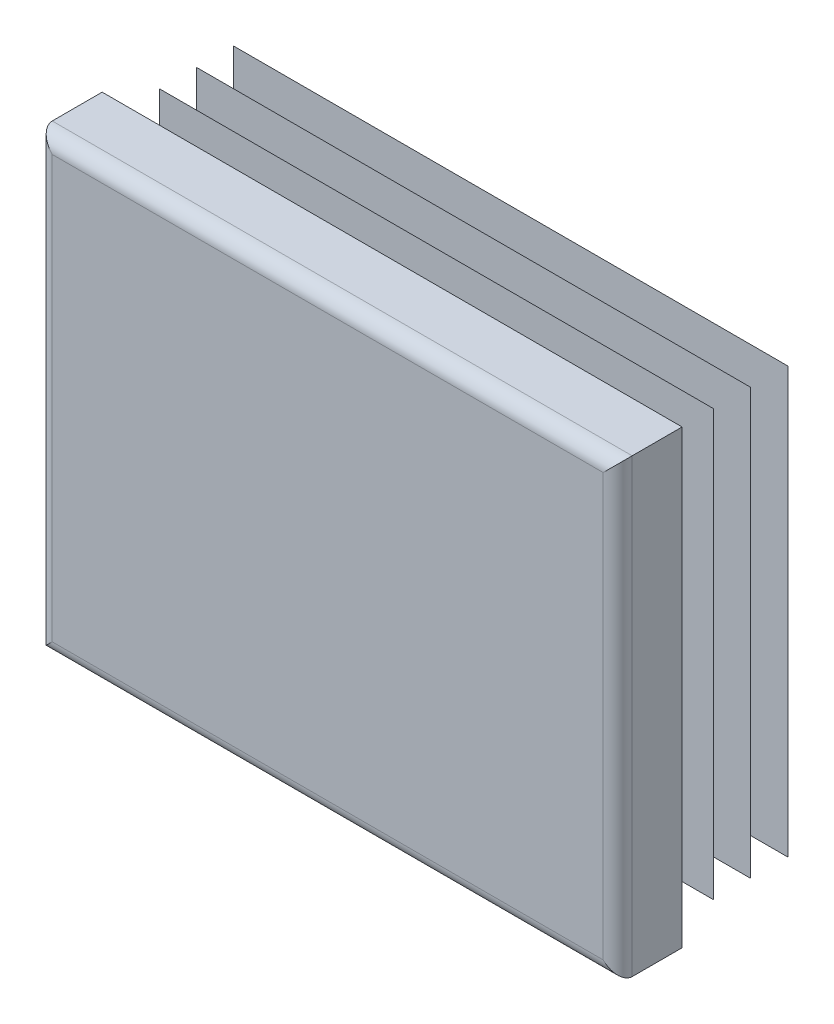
ISO-10303-21;
HEADER;
FILE_DESCRIPTION(('STEP AP214'),'2;1');
FILE_NAME('part.step','',(''),(''),'','','');
FILE_SCHEMA(('AUTOMOTIVE_DESIGN { 1 0 10303 214 1 1 1 1 }'));
ENDSEC;
DATA;
#1=APPLICATION_CONTEXT('core data for automotive mechanical design processes');
#2=APPLICATION_PROTOCOL_DEFINITION('international standard','automotive_design',2000,#1);
#3=PRODUCT_CONTEXT('',#1,'mechanical');
#4=PRODUCT('Part','Part','',(#3));
#5=PRODUCT_RELATED_PRODUCT_CATEGORY('part','',(#4));
#6=PRODUCT_DEFINITION_FORMATION('','',#4);
#7=PRODUCT_DEFINITION_CONTEXT('part definition',#1,'design');
#8=PRODUCT_DEFINITION('design','',#6,#7);
#9=PRODUCT_DEFINITION_SHAPE('','',#8);
#10=(LENGTH_UNIT() NAMED_UNIT(*) SI_UNIT(.MILLI.,.METRE.));
#11=(NAMED_UNIT(*) PLANE_ANGLE_UNIT() SI_UNIT($,.RADIAN.));
#12=(NAMED_UNIT(*) SI_UNIT($,.STERADIAN.) SOLID_ANGLE_UNIT());
#13=UNCERTAINTY_MEASURE_WITH_UNIT(LENGTH_MEASURE(1.E-05),#10,'distance_accuracy_value','');
#14=(GEOMETRIC_REPRESENTATION_CONTEXT(3) GLOBAL_UNCERTAINTY_ASSIGNED_CONTEXT((#13)) GLOBAL_UNIT_ASSIGNED_CONTEXT((#10,
#11,#12)) REPRESENTATION_CONTEXT('',''));
#15=CARTESIAN_POINT('',(0.,0.,0.));
#16=DIRECTION('',(0.,0.,1.));
#17=DIRECTION('',(1.,0.,0.));
#18=AXIS2_PLACEMENT_3D('',#15,#16,#17);
#19=CARTESIAN_POINT('',(21.375,-17.5,5.));
#20=DIRECTION('',(0.,0.,-1.));
#21=DIRECTION('',(0.,1.,0.));
#22=AXIS2_PLACEMENT_3D('',#19,#20,#21);
#23=PLANE('',#22);
#24=DIRECTION('',(0.,1.,0.));
#25=VECTOR('',#24,1.);
#26=CARTESIAN_POINT('',(-21.375,-17.5,5.));
#27=LINE('',#26,#25);
#28=CARTESIAN_POINT('',(-21.375,-16.375,5.));
#29=VERTEX_POINT('',#28);
#30=CARTESIAN_POINT('',(-21.375,16.375,5.));
#31=VERTEX_POINT('',#30);
#32=EDGE_CURVE('E310',#29,#31,#27,.T.);
#33=ORIENTED_EDGE('',*,*,#32,.F.);
#34=DIRECTION('',(-1.,0.,0.));
#35=VECTOR('',#34,1.);
#36=CARTESIAN_POINT('',(22.5,-16.375,5.));
#37=LINE('',#36,#35);
#38=CARTESIAN_POINT('',(21.375,-16.375,5.));
#39=VERTEX_POINT('',#38);
#40=EDGE_CURVE('E482',#39,#29,#37,.T.);
#41=ORIENTED_EDGE('',*,*,#40,.F.);
#42=DIRECTION('',(0.,1.,0.));
#43=VECTOR('',#42,1.);
#44=CARTESIAN_POINT('',(21.375,-17.5,5.));
#45=LINE('',#44,#43);
#46=CARTESIAN_POINT('',(21.375,16.375,5.));
#47=VERTEX_POINT('',#46);
#48=EDGE_CURVE('E305',#39,#47,#45,.T.);
#49=ORIENTED_EDGE('',*,*,#48,.T.);
#50=DIRECTION('',(-1.,0.,0.));
#51=VECTOR('',#50,1.);
#52=CARTESIAN_POINT('',(22.5,16.375,5.));
#53=LINE('',#52,#51);
#54=EDGE_CURVE('E630',#47,#31,#53,.T.);
#55=ORIENTED_EDGE('',*,*,#54,.T.);
#56=EDGE_LOOP('',(#33,#41,#49,#55));
#57=FACE_BOUND('',#56,.T.);
#58=ADVANCED_FACE('F14',(#57),#23,.F.);
#59=CARTESIAN_POINT('',(-21.375,-17.5,3.875));
#60=DIRECTION('',(0.,1.,0.));
#61=DIRECTION('',(-1.,0.,0.));
#62=AXIS2_PLACEMENT_3D('',#59,#60,#61);
#63=CYLINDRICAL_SURFACE('',#62,1.125);
#64=DIRECTION('',(0.,1.,0.));
#65=VECTOR('',#64,1.);
#66=CARTESIAN_POINT('',(-22.5,-17.5,3.875));
#67=LINE('',#66,#65);
#68=CARTESIAN_POINT('',(-22.5,-17.5,3.875));
#69=VERTEX_POINT('',#68);
#70=CARTESIAN_POINT('',(-22.5,17.5,3.875));
#71=VERTEX_POINT('',#70);
#72=EDGE_CURVE('E402',#69,#71,#67,.T.);
#73=ORIENTED_EDGE('',*,*,#72,.F.);
#74=CARTESIAN_POINT('',(-21.375,-16.375,3.875));
#75=DIRECTION('',(-0.707106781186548,0.707106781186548,0.));
#76=DIRECTION('',(0.707106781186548,0.707106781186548,0.));
#77=AXIS2_PLACEMENT_3D('',#74,#75,#76);
#78=ELLIPSE('',#77,1.59099025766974,1.125);
#79=EDGE_CURVE('E59',#69,#29,#78,.T.);
#80=ORIENTED_EDGE('',*,*,#79,.T.);
#81=ORIENTED_EDGE('',*,*,#32,.T.);
#82=CARTESIAN_POINT('',(-21.375,16.375,3.875));
#83=DIRECTION('',(0.707106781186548,0.707106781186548,0.));
#84=DIRECTION('',(-0.707106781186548,0.707106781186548,0.));
#85=AXIS2_PLACEMENT_3D('',#82,#83,#84);
#86=ELLIPSE('',#85,1.59099025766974,1.125);
#87=EDGE_CURVE('E306',#31,#71,#86,.F.);
#88=ORIENTED_EDGE('',*,*,#87,.T.);
#89=EDGE_LOOP('',(#73,#80,#81,#88));
#90=FACE_BOUND('',#89,.T.);
#91=ADVANCED_FACE('F16',(#90),#63,.T.);
#92=CARTESIAN_POINT('',(-22.5,-17.5,3.875));
#93=DIRECTION('',(1.,0.,0.));
#94=DIRECTION('',(0.,1.,0.));
#95=AXIS2_PLACEMENT_3D('',#92,#93,#94);
#96=PLANE('',#95);
#97=DIRECTION('',(0.,0.,-1.));
#98=VECTOR('',#97,1.);
#99=CARTESIAN_POINT('',(-22.5,17.5,3.875));
#100=LINE('',#99,#98);
#101=CARTESIAN_POINT('',(-22.5,17.5,0.));
#102=VERTEX_POINT('',#101);
#103=EDGE_CURVE('E615',#71,#102,#100,.T.);
#104=ORIENTED_EDGE('',*,*,#103,.T.);
#105=DIRECTION('',(0.,1.,0.));
#106=VECTOR('',#105,1.);
#107=CARTESIAN_POINT('',(-22.5,-17.5,0.));
#108=LINE('',#107,#106);
#109=CARTESIAN_POINT('',(-22.5,-17.5,0.));
#110=VERTEX_POINT('',#109);
#111=EDGE_CURVE('E400',#110,#102,#108,.T.);
#112=ORIENTED_EDGE('',*,*,#111,.F.);
#113=DIRECTION('',(0.,0.,-1.));
#114=VECTOR('',#113,1.);
#115=CARTESIAN_POINT('',(-22.5,-17.5,3.875));
#116=LINE('',#115,#114);
#117=EDGE_CURVE('E616',#69,#110,#116,.T.);
#118=ORIENTED_EDGE('',*,*,#117,.F.);
#119=ORIENTED_EDGE('',*,*,#72,.T.);
#120=EDGE_LOOP('',(#104,#112,#118,#119));
#121=FACE_BOUND('',#120,.T.);
#122=ADVANCED_FACE('F697',(#121),#96,.F.);
#123=CARTESIAN_POINT('',(-18.5,-17.5,0.));
#124=DIRECTION('',(1.,0.,0.));
#125=DIRECTION('',(0.,1.,0.));
#126=AXIS2_PLACEMENT_3D('',#123,#124,#125);
#127=PLANE('',#126);
#128=DIRECTION('',(0.,1.,0.));
#129=VECTOR('',#128,1.);
#130=CARTESIAN_POINT('',(-18.5,-17.5,0.));
#131=LINE('',#130,#129);
#132=CARTESIAN_POINT('',(-18.5,-13.5,0.));
#133=VERTEX_POINT('',#132);
#134=CARTESIAN_POINT('',(-18.5,13.5,0.));
#135=VERTEX_POINT('',#134);
#136=EDGE_CURVE('E397',#133,#135,#131,.T.);
#137=ORIENTED_EDGE('',*,*,#136,.T.);
#138=DIRECTION('',(0.,0.,-1.));
#139=VECTOR('',#138,1.);
#140=CARTESIAN_POINT('',(-18.5,13.5,0.));
#141=LINE('',#140,#139);
#142=CARTESIAN_POINT('',(-18.5,13.5,-0.575));
#143=VERTEX_POINT('',#142);
#144=EDGE_CURVE('E495',#135,#143,#141,.T.);
#145=ORIENTED_EDGE('',*,*,#144,.T.);
#146=DIRECTION('',(0.,1.,0.));
#147=VECTOR('',#146,1.);
#148=CARTESIAN_POINT('',(-18.5,-17.5,-0.575));
#149=LINE('',#148,#147);
#150=CARTESIAN_POINT('',(-18.5,-13.5,-0.575));
#151=VERTEX_POINT('',#150);
#152=EDGE_CURVE('E394',#151,#143,#149,.T.);
#153=ORIENTED_EDGE('',*,*,#152,.F.);
#154=DIRECTION('',(0.,0.,1.));
#155=VECTOR('',#154,1.);
#156=CARTESIAN_POINT('',(-18.5,-13.5,0.));
#157=LINE('',#156,#155);
#158=EDGE_CURVE('E489',#151,#133,#157,.T.);
#159=ORIENTED_EDGE('',*,*,#158,.T.);
#160=EDGE_LOOP('',(#137,#145,#153,#159));
#161=FACE_BOUND('',#160,.T.);
#162=ADVANCED_FACE('F787',(#161),#127,.F.);
#163=CARTESIAN_POINT('',(-21.5,-17.5,-0.575));
#164=DIRECTION('',(0.342020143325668,0.,0.939692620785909));
#165=DIRECTION('',(-0.939692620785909,0.,0.342020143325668));
#166=AXIS2_PLACEMENT_3D('',#163,#164,#165);
#167=PLANE('',#166);
#168=DIRECTION('',(0.,1.,0.));
#169=VECTOR('',#168,1.);
#170=CARTESIAN_POINT('',(-21.5,-17.5,-0.575));
#171=LINE('',#170,#169);
#172=CARTESIAN_POINT('',(-21.5,-16.5,-0.575));
#173=VERTEX_POINT('',#172);
#174=CARTESIAN_POINT('',(-21.5,16.5,-0.575));
#175=VERTEX_POINT('',#174);
#176=EDGE_CURVE('E392',#173,#175,#171,.T.);
#177=ORIENTED_EDGE('',*,*,#176,.T.);
#178=DIRECTION('',(0.844349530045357,-0.43889572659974,-0.307318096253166));
#179=VECTOR('',#178,1.);
#180=CARTESIAN_POINT('',(-8.90023238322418,9.95059839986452,-5.1609403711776));
#181=LINE('',#180,#179);
#182=CARTESIAN_POINT('',(-18.5,14.9405899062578,-1.6669107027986));
#183=VERTEX_POINT('',#182);
#184=EDGE_CURVE('E519',#175,#183,#181,.T.);
#185=ORIENTED_EDGE('',*,*,#184,.T.);
#186=DIRECTION('',(0.,1.,0.));
#187=VECTOR('',#186,1.);
#188=CARTESIAN_POINT('',(-18.5,-17.5,-1.6669107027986));
#189=LINE('',#188,#187);
#190=CARTESIAN_POINT('',(-18.5,-14.9405899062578,-1.6669107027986));
#191=VERTEX_POINT('',#190);
#192=EDGE_CURVE('E389',#191,#183,#189,.T.);
#193=ORIENTED_EDGE('',*,*,#192,.F.);
#194=DIRECTION('',(-0.844349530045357,-0.43889572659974,0.307318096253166));
#195=VECTOR('',#194,1.);
#196=CARTESIAN_POINT('',(-21.8705814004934,-16.6926294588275,-0.440119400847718));
#197=LINE('',#196,#195);
#198=EDGE_CURVE('E507',#191,#173,#197,.T.);
#199=ORIENTED_EDGE('',*,*,#198,.T.);
#200=EDGE_LOOP('',(#177,#185,#193,#199));
#201=FACE_BOUND('',#200,.T.);
#202=ADVANCED_FACE('F783',(#201),#167,.F.);
#203=CARTESIAN_POINT('',(-18.5,-17.5,-1.6669107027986));
#204=DIRECTION('',(1.,0.,0.));
#205=DIRECTION('',(0.,1.,0.));
#206=AXIS2_PLACEMENT_3D('',#203,#204,#205);
#207=PLANE('',#206);
#208=ORIENTED_EDGE('',*,*,#192,.T.);
#209=DIRECTION('',(0.,-0.819152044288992,-0.573576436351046));
#210=VECTOR('',#209,1.);
#211=CARTESIAN_POINT('',(-18.5,-6.82737265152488,-16.9090021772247));
#212=LINE('',#211,#210);
#213=CARTESIAN_POINT('',(-18.5,13.5,-2.67562261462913));
#214=VERTEX_POINT('',#213);
#215=EDGE_CURVE('E516',#183,#214,#212,.T.);
#216=ORIENTED_EDGE('',*,*,#215,.T.);
#217=DIRECTION('',(0.,0.,-1.));
#218=VECTOR('',#217,1.);
#219=CARTESIAN_POINT('',(-18.5,13.5,-1.6669107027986));
#220=LINE('',#219,#218);
#221=CARTESIAN_POINT('',(-18.5,13.5,-3.45));
#222=VERTEX_POINT('',#221);
#223=EDGE_CURVE('E525',#214,#222,#220,.T.);
#224=ORIENTED_EDGE('',*,*,#223,.T.);
#225=DIRECTION('',(0.,1.,0.));
#226=VECTOR('',#225,1.);
#227=CARTESIAN_POINT('',(-18.5,-17.5,-3.45));
#228=LINE('',#227,#226);
#229=CARTESIAN_POINT('',(-18.5,-13.5,-3.45));
#230=VERTEX_POINT('',#229);
#231=EDGE_CURVE('E386',#230,#222,#228,.T.);
#232=ORIENTED_EDGE('',*,*,#231,.F.);
#233=DIRECTION('',(0.,0.,1.));
#234=VECTOR('',#233,1.);
#235=CARTESIAN_POINT('',(-18.5,-13.5,-1.6669107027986));
#236=LINE('',#235,#234);
#237=CARTESIAN_POINT('',(-18.5,-13.5,-2.67562261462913));
#238=VERTEX_POINT('',#237);
#239=EDGE_CURVE('E522',#230,#238,#236,.T.);
#240=ORIENTED_EDGE('',*,*,#239,.T.);
#241=DIRECTION('',(0.,-0.819152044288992,0.573576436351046));
#242=VECTOR('',#241,1.);
#243=CARTESIAN_POINT('',(-18.5,-16.6579798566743,-0.464381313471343));
#244=LINE('',#243,#242);
#245=EDGE_CURVE('E504',#238,#191,#244,.T.);
#246=ORIENTED_EDGE('',*,*,#245,.T.);
#247=EDGE_LOOP('',(#208,#216,#224,#232,#240,#246));
#248=FACE_BOUND('',#247,.T.);
#249=ADVANCED_FACE('F779',(#248),#207,.F.);
#250=CARTESIAN_POINT('',(-21.5,-17.5,-3.45));
#251=DIRECTION('',(0.342020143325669,0.,0.939692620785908));
#252=DIRECTION('',(-0.939692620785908,0.,0.342020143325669));
#253=AXIS2_PLACEMENT_3D('',#250,#251,#252);
#254=PLANE('',#253);
#255=DIRECTION('',(0.,1.,0.));
#256=VECTOR('',#255,1.);
#257=CARTESIAN_POINT('',(-21.5,-17.5,-3.45));
#258=LINE('',#257,#256);
#259=CARTESIAN_POINT('',(-21.5,-16.5,-3.45));
#260=VERTEX_POINT('',#259);
#261=CARTESIAN_POINT('',(-21.5,16.5,-3.45));
#262=VERTEX_POINT('',#261);
#263=EDGE_CURVE('E384',#260,#262,#258,.T.);
#264=ORIENTED_EDGE('',*,*,#263,.T.);
#265=DIRECTION('',(0.844349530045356,-0.438895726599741,-0.307318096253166));
#266=VECTOR('',#265,1.);
#267=CARTESIAN_POINT('',(-8.90023238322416,9.95059839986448,-8.03594037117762));
#268=LINE('',#267,#266);
#269=CARTESIAN_POINT('',(-18.5,14.9405899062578,-4.54191070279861));
#270=VERTEX_POINT('',#269);
#271=EDGE_CURVE('E549',#262,#270,#268,.T.);
#272=ORIENTED_EDGE('',*,*,#271,.T.);
#273=DIRECTION('',(0.,1.,0.));
#274=VECTOR('',#273,1.);
#275=CARTESIAN_POINT('',(-18.5,-17.5,-4.54191070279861));
#276=LINE('',#275,#274);
#277=CARTESIAN_POINT('',(-18.5,-14.9405899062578,-4.54191070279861));
#278=VERTEX_POINT('',#277);
#279=EDGE_CURVE('E381',#278,#270,#276,.T.);
#280=ORIENTED_EDGE('',*,*,#279,.F.);
#281=DIRECTION('',(-0.844349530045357,-0.438895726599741,0.307318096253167));
#282=VECTOR('',#281,1.);
#283=CARTESIAN_POINT('',(-21.8705814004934,-16.6926294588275,-3.31511940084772));
#284=LINE('',#283,#282);
#285=EDGE_CURVE('E537',#278,#260,#284,.T.);
#286=ORIENTED_EDGE('',*,*,#285,.T.);
#287=EDGE_LOOP('',(#264,#272,#280,#286));
#288=FACE_BOUND('',#287,.T.);
#289=ADVANCED_FACE('F775',(#288),#254,.F.);
#290=CARTESIAN_POINT('',(-18.5,-17.5,-4.54191070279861));
#291=DIRECTION('',(1.,0.,0.));
#292=DIRECTION('',(0.,1.,0.));
#293=AXIS2_PLACEMENT_3D('',#290,#291,#292);
#294=PLANE('',#293);
#295=ORIENTED_EDGE('',*,*,#279,.T.);
#296=DIRECTION('',(0.,-0.819152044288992,-0.573576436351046));
#297=VECTOR('',#296,1.);
#298=CARTESIAN_POINT('',(-18.5,-6.82737265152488,-19.7840021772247));
#299=LINE('',#298,#297);
#300=CARTESIAN_POINT('',(-18.5,13.5,-5.55062261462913));
#301=VERTEX_POINT('',#300);
#302=EDGE_CURVE('E546',#270,#301,#299,.T.);
#303=ORIENTED_EDGE('',*,*,#302,.T.);
#304=DIRECTION('',(0.,0.,-1.));
#305=VECTOR('',#304,1.);
#306=CARTESIAN_POINT('',(-18.5,13.5,-4.54191070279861));
#307=LINE('',#306,#305);
#308=CARTESIAN_POINT('',(-18.5,13.5,-6.325));
#309=VERTEX_POINT('',#308);
#310=EDGE_CURVE('E555',#301,#309,#307,.T.);
#311=ORIENTED_EDGE('',*,*,#310,.T.);
#312=DIRECTION('',(0.,1.,0.));
#313=VECTOR('',#312,1.);
#314=CARTESIAN_POINT('',(-18.5,-17.5,-6.325));
#315=LINE('',#314,#313);
#316=CARTESIAN_POINT('',(-18.5,-13.5,-6.325));
#317=VERTEX_POINT('',#316);
#318=EDGE_CURVE('E378',#317,#309,#315,.T.);
#319=ORIENTED_EDGE('',*,*,#318,.F.);
#320=DIRECTION('',(0.,0.,1.));
#321=VECTOR('',#320,1.);
#322=CARTESIAN_POINT('',(-18.5,-13.5,-4.54191070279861));
#323=LINE('',#322,#321);
#324=CARTESIAN_POINT('',(-18.5,-13.5,-5.55062261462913));
#325=VERTEX_POINT('',#324);
#326=EDGE_CURVE('E552',#317,#325,#323,.T.);
#327=ORIENTED_EDGE('',*,*,#326,.T.);
#328=DIRECTION('',(0.,-0.819152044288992,0.573576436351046));
#329=VECTOR('',#328,1.);
#330=CARTESIAN_POINT('',(-18.5,-16.6579798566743,-3.33938131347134));
#331=LINE('',#330,#329);
#332=EDGE_CURVE('E534',#325,#278,#331,.T.);
#333=ORIENTED_EDGE('',*,*,#332,.T.);
#334=EDGE_LOOP('',(#295,#303,#311,#319,#327,#333));
#335=FACE_BOUND('',#334,.T.);
#336=ADVANCED_FACE('F771',(#335),#294,.F.);
#337=CARTESIAN_POINT('',(-21.5,-17.5,-6.325));
#338=DIRECTION('',(0.342020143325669,0.,0.939692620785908));
#339=DIRECTION('',(-0.939692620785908,0.,0.342020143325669));
#340=AXIS2_PLACEMENT_3D('',#337,#338,#339);
#341=PLANE('',#340);
#342=DIRECTION('',(0.,1.,0.));
#343=VECTOR('',#342,1.);
#344=CARTESIAN_POINT('',(-21.5,-17.5,-6.325));
#345=LINE('',#344,#343);
#346=CARTESIAN_POINT('',(-21.5,-16.5,-6.325));
#347=VERTEX_POINT('',#346);
#348=CARTESIAN_POINT('',(-21.5,16.5,-6.325));
#349=VERTEX_POINT('',#348);
#350=EDGE_CURVE('E376',#347,#349,#345,.T.);
#351=ORIENTED_EDGE('',*,*,#350,.T.);
#352=DIRECTION('',(0.844349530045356,-0.438895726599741,-0.307318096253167));
#353=VECTOR('',#352,1.);
#354=CARTESIAN_POINT('',(-8.90023238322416,9.95059839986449,-10.9109403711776));
#355=LINE('',#354,#353);
#356=CARTESIAN_POINT('',(-18.5,14.9405899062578,-7.41691070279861));
#357=VERTEX_POINT('',#356);
#358=EDGE_CURVE('E579',#349,#357,#355,.T.);
#359=ORIENTED_EDGE('',*,*,#358,.T.);
#360=DIRECTION('',(0.,1.,0.));
#361=VECTOR('',#360,1.);
#362=CARTESIAN_POINT('',(-18.5,-17.5,-7.41691070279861));
#363=LINE('',#362,#361);
#364=CARTESIAN_POINT('',(-18.5,-14.9405899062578,-7.41691070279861));
#365=VERTEX_POINT('',#364);
#366=EDGE_CURVE('E373',#365,#357,#363,.T.);
#367=ORIENTED_EDGE('',*,*,#366,.F.);
#368=DIRECTION('',(-0.844349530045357,-0.438895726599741,0.307318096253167));
#369=VECTOR('',#368,1.);
#370=CARTESIAN_POINT('',(-21.8705814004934,-16.6926294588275,-6.19011940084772));
#371=LINE('',#370,#369);
#372=EDGE_CURVE('E567',#365,#347,#371,.T.);
#373=ORIENTED_EDGE('',*,*,#372,.T.);
#374=EDGE_LOOP('',(#351,#359,#367,#373));
#375=FACE_BOUND('',#374,.T.);
#376=ADVANCED_FACE('F767',(#375),#341,.F.);
#377=CARTESIAN_POINT('',(-18.5,-17.5,-7.41691070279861));
#378=DIRECTION('',(1.,0.,0.));
#379=DIRECTION('',(0.,1.,0.));
#380=AXIS2_PLACEMENT_3D('',#377,#378,#379);
#381=PLANE('',#380);
#382=ORIENTED_EDGE('',*,*,#366,.T.);
#383=DIRECTION('',(0.,-0.819152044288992,-0.573576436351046));
#384=VECTOR('',#383,1.);
#385=CARTESIAN_POINT('',(-18.5,-6.82737265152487,-22.6590021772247));
#386=LINE('',#385,#384);
#387=CARTESIAN_POINT('',(-18.5,13.5,-8.42562261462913));
#388=VERTEX_POINT('',#387);
#389=EDGE_CURVE('E576',#357,#388,#386,.T.);
#390=ORIENTED_EDGE('',*,*,#389,.T.);
#391=DIRECTION('',(0.,0.,-1.));
#392=VECTOR('',#391,1.);
#393=CARTESIAN_POINT('',(-18.5,13.5,-7.41691070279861));
#394=LINE('',#393,#392);
#395=CARTESIAN_POINT('',(-18.5,13.5,-9.2));
#396=VERTEX_POINT('',#395);
#397=EDGE_CURVE('E585',#388,#396,#394,.T.);
#398=ORIENTED_EDGE('',*,*,#397,.T.);
#399=DIRECTION('',(0.,1.,0.));
#400=VECTOR('',#399,1.);
#401=CARTESIAN_POINT('',(-18.5,-17.5,-9.2));
#402=LINE('',#401,#400);
#403=CARTESIAN_POINT('',(-18.5,-13.5,-9.2));
#404=VERTEX_POINT('',#403);
#405=EDGE_CURVE('E370',#404,#396,#402,.T.);
#406=ORIENTED_EDGE('',*,*,#405,.F.);
#407=DIRECTION('',(0.,0.,1.));
#408=VECTOR('',#407,1.);
#409=CARTESIAN_POINT('',(-18.5,-13.5,-7.41691070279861));
#410=LINE('',#409,#408);
#411=CARTESIAN_POINT('',(-18.5,-13.5,-8.42562261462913));
#412=VERTEX_POINT('',#411);
#413=EDGE_CURVE('E582',#404,#412,#410,.T.);
#414=ORIENTED_EDGE('',*,*,#413,.T.);
#415=DIRECTION('',(0.,-0.819152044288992,0.573576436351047));
#416=VECTOR('',#415,1.);
#417=CARTESIAN_POINT('',(-18.5,-16.6579798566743,-6.21438131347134));
#418=LINE('',#417,#416);
#419=EDGE_CURVE('E564',#412,#365,#418,.T.);
#420=ORIENTED_EDGE('',*,*,#419,.T.);
#421=EDGE_LOOP('',(#382,#390,#398,#406,#414,#420));
#422=FACE_BOUND('',#421,.T.);
#423=ADVANCED_FACE('F764',(#422),#381,.F.);
#424=CARTESIAN_POINT('',(-21.5,-17.5,-9.2));
#425=DIRECTION('',(0.342020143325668,0.,0.939692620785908));
#426=DIRECTION('',(-0.939692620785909,0.,0.342020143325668));
#427=AXIS2_PLACEMENT_3D('',#424,#425,#426);
#428=PLANE('',#427);
#429=DIRECTION('',(0.,1.,0.));
#430=VECTOR('',#429,1.);
#431=CARTESIAN_POINT('',(-21.5,-17.5,-9.2));
#432=LINE('',#431,#430);
#433=CARTESIAN_POINT('',(-21.5,-16.5,-9.2));
#434=VERTEX_POINT('',#433);
#435=CARTESIAN_POINT('',(-21.5,16.5,-9.2));
#436=VERTEX_POINT('',#435);
#437=EDGE_CURVE('E368',#434,#436,#432,.T.);
#438=ORIENTED_EDGE('',*,*,#437,.T.);
#439=DIRECTION('',(0.844349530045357,-0.438895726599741,-0.307318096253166));
#440=VECTOR('',#439,1.);
#441=CARTESIAN_POINT('',(-8.90023238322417,9.95059839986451,-13.7859403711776));
#442=LINE('',#441,#440);
#443=CARTESIAN_POINT('',(-18.5,14.9405899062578,-10.2919107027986));
#444=VERTEX_POINT('',#443);
#445=EDGE_CURVE('E607',#436,#444,#442,.T.);
#446=ORIENTED_EDGE('',*,*,#445,.T.);
#447=DIRECTION('',(0.,1.,0.));
#448=VECTOR('',#447,1.);
#449=CARTESIAN_POINT('',(-18.5,-17.5,-10.2919107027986));
#450=LINE('',#449,#448);
#451=CARTESIAN_POINT('',(-18.5,-14.9405899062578,-10.2919107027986));
#452=VERTEX_POINT('',#451);
#453=EDGE_CURVE('E365',#452,#444,#450,.T.);
#454=ORIENTED_EDGE('',*,*,#453,.F.);
#455=DIRECTION('',(-0.844349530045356,-0.438895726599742,0.307318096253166));
#456=VECTOR('',#455,1.);
#457=CARTESIAN_POINT('',(-21.8705814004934,-16.6926294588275,-9.06511940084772));
#458=LINE('',#457,#456);
#459=EDGE_CURVE('E595',#452,#434,#458,.T.);
#460=ORIENTED_EDGE('',*,*,#459,.T.);
#461=EDGE_LOOP('',(#438,#446,#454,#460));
#462=FACE_BOUND('',#461,.T.);
#463=ADVANCED_FACE('F675',(#462),#428,.F.);
#464=CARTESIAN_POINT('',(-18.5,-17.5,-10.2919107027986));
#465=DIRECTION('',(1.,0.,0.));
#466=DIRECTION('',(0.,1.,0.));
#467=AXIS2_PLACEMENT_3D('',#464,#465,#466);
#468=PLANE('',#467);
#469=ORIENTED_EDGE('',*,*,#453,.T.);
#470=DIRECTION('',(0.,-0.819152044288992,-0.573576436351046));
#471=VECTOR('',#470,1.);
#472=CARTESIAN_POINT('',(-18.5,-6.82737265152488,-25.5340021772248));
#473=LINE('',#472,#471);
#474=CARTESIAN_POINT('',(-18.5,13.5,-11.3006226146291));
#475=VERTEX_POINT('',#474);
#476=EDGE_CURVE('E604',#444,#475,#473,.T.);
#477=ORIENTED_EDGE('',*,*,#476,.T.);
#478=DIRECTION('',(0.,0.,-1.));
#479=VECTOR('',#478,1.);
#480=CARTESIAN_POINT('',(-18.5,13.5,-10.2919107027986));
#481=LINE('',#480,#479);
#482=CARTESIAN_POINT('',(-18.5,13.5,-11.5));
#483=VERTEX_POINT('',#482);
#484=EDGE_CURVE('E613',#475,#483,#481,.T.);
#485=ORIENTED_EDGE('',*,*,#484,.T.);
#486=DIRECTION('',(0.,1.,0.));
#487=VECTOR('',#486,1.);
#488=CARTESIAN_POINT('',(-18.5,-17.5,-11.5));
#489=LINE('',#488,#487);
#490=CARTESIAN_POINT('',(-18.5,-13.5,-11.5));
#491=VERTEX_POINT('',#490);
#492=EDGE_CURVE('E362',#491,#483,#489,.T.);
#493=ORIENTED_EDGE('',*,*,#492,.F.);
#494=DIRECTION('',(0.,0.,1.));
#495=VECTOR('',#494,1.);
#496=CARTESIAN_POINT('',(-18.5,-13.5,-10.2919107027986));
#497=LINE('',#496,#495);
#498=CARTESIAN_POINT('',(-18.5,-13.5,-11.3006226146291));
#499=VERTEX_POINT('',#498);
#500=EDGE_CURVE('E610',#491,#499,#497,.T.);
#501=ORIENTED_EDGE('',*,*,#500,.T.);
#502=DIRECTION('',(0.,-0.819152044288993,0.573576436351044));
#503=VECTOR('',#502,1.);
#504=CARTESIAN_POINT('',(-18.5,-16.6579798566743,-9.08938131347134));
#505=LINE('',#504,#503);
#506=EDGE_CURVE('E592',#499,#452,#505,.T.);
#507=ORIENTED_EDGE('',*,*,#506,.T.);
#508=EDGE_LOOP('',(#469,#477,#485,#493,#501,#507));
#509=FACE_BOUND('',#508,.T.);
#510=ADVANCED_FACE('F677',(#509),#468,.F.);
#511=CARTESIAN_POINT('',(-18.5,-17.5,-11.5));
#512=DIRECTION('',(0.,0.,1.));
#513=DIRECTION('',(0.,-1.,0.));
#514=AXIS2_PLACEMENT_3D('',#511,#512,#513);
#515=PLANE('',#514);
#516=ORIENTED_EDGE('',*,*,#492,.T.);
#517=DIRECTION('',(-1.,0.,0.));
#518=VECTOR('',#517,1.);
#519=CARTESIAN_POINT('',(22.5,13.5,-11.5));
#520=LINE('',#519,#518);
#521=CARTESIAN_POINT('',(18.5,13.5,-11.5));
#522=VERTEX_POINT('',#521);
#523=EDGE_CURVE('E438',#522,#483,#520,.T.);
#524=ORIENTED_EDGE('',*,*,#523,.F.);
#525=DIRECTION('',(0.,1.,0.));
#526=VECTOR('',#525,1.);
#527=CARTESIAN_POINT('',(18.5,-17.5,-11.5));
#528=LINE('',#527,#526);
#529=CARTESIAN_POINT('',(18.5,-13.5,-11.5));
#530=VERTEX_POINT('',#529);
#531=EDGE_CURVE('E359',#530,#522,#528,.T.);
#532=ORIENTED_EDGE('',*,*,#531,.F.);
#533=DIRECTION('',(-1.,0.,0.));
#534=VECTOR('',#533,1.);
#535=CARTESIAN_POINT('',(22.5,-13.5,-11.5));
#536=LINE('',#535,#534);
#537=EDGE_CURVE('E436',#530,#491,#536,.T.);
#538=ORIENTED_EDGE('',*,*,#537,.T.);
#539=EDGE_LOOP('',(#516,#524,#532,#538));
#540=FACE_BOUND('',#539,.T.);
#541=ADVANCED_FACE('F435',(#540),#515,.F.);
#542=CARTESIAN_POINT('',(18.5,-17.5,-11.5));
#543=DIRECTION('',(-1.,0.,0.));
#544=DIRECTION('',(0.,-1.,0.));
#545=AXIS2_PLACEMENT_3D('',#542,#543,#544);
#546=PLANE('',#545);
#547=DIRECTION('',(0.,0.,1.));
#548=VECTOR('',#547,1.);
#549=CARTESIAN_POINT('',(18.5,13.5,-11.5));
#550=LINE('',#549,#548);
#551=CARTESIAN_POINT('',(18.5,13.5,-11.3006226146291));
#552=VERTEX_POINT('',#551);
#553=EDGE_CURVE('E9',#522,#552,#550,.T.);
#554=ORIENTED_EDGE('',*,*,#553,.T.);
#555=DIRECTION('',(0.,0.819152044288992,0.573576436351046));
#556=VECTOR('',#555,1.);
#557=CARTESIAN_POINT('',(18.5,-7.39498895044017,-25.9314513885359));
#558=LINE('',#557,#556);
#559=CARTESIAN_POINT('',(18.5,14.9405899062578,-10.2919107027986));
#560=VERTEX_POINT('',#559);
#561=EDGE_CURVE('E601',#552,#560,#558,.T.);
#562=ORIENTED_EDGE('',*,*,#561,.T.);
#563=DIRECTION('',(0.,1.,0.));
#564=VECTOR('',#563,1.);
#565=CARTESIAN_POINT('',(18.5,-17.5,-10.2919107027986));
#566=LINE('',#565,#564);
#567=CARTESIAN_POINT('',(18.5,-14.9405899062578,-10.2919107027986));
#568=VERTEX_POINT('',#567);
#569=EDGE_CURVE('E356',#568,#560,#566,.T.);
#570=ORIENTED_EDGE('',*,*,#569,.F.);
#571=DIRECTION('',(0.,0.819152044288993,-0.573576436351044));
#572=VECTOR('',#571,1.);
#573=CARTESIAN_POINT('',(18.5,-16.0903635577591,-9.48683052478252));
#574=LINE('',#573,#572);
#575=CARTESIAN_POINT('',(18.5,-13.5,-11.3006226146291));
#576=VERTEX_POINT('',#575);
#577=EDGE_CURVE('E428',#568,#576,#574,.T.);
#578=ORIENTED_EDGE('',*,*,#577,.T.);
#579=DIRECTION('',(0.,0.,-1.));
#580=VECTOR('',#579,1.);
#581=CARTESIAN_POINT('',(18.5,-13.5,-11.5));
#582=LINE('',#581,#580);
#583=EDGE_CURVE('E23',#576,#530,#582,.T.);
#584=ORIENTED_EDGE('',*,*,#583,.T.);
#585=ORIENTED_EDGE('',*,*,#531,.T.);
#586=EDGE_LOOP('',(#554,#562,#570,#578,#584,#585));
#587=FACE_BOUND('',#586,.T.);
#588=ADVANCED_FACE('F426',(#587),#546,.F.);
#589=CARTESIAN_POINT('',(18.5,-17.5,-10.2919107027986));
#590=DIRECTION('',(-0.342020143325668,0.,0.939692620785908));
#591=DIRECTION('',(-0.939692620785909,0.,-0.342020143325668));
#592=AXIS2_PLACEMENT_3D('',#589,#590,#591);
#593=PLANE('',#592);
#594=ORIENTED_EDGE('',*,*,#569,.T.);
#595=DIRECTION('',(0.844349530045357,0.438895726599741,0.307318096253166));
#596=VECTOR('',#595,1.);
#597=CARTESIAN_POINT('',(6.47812075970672,8.69157662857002,-14.6675169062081));
#598=LINE('',#597,#596);
#599=CARTESIAN_POINT('',(21.5,16.5,-9.2));
#600=VERTEX_POINT('',#599);
#601=EDGE_CURVE('E598',#560,#600,#598,.T.);
#602=ORIENTED_EDGE('',*,*,#601,.T.);
#603=DIRECTION('',(0.,1.,0.));
#604=VECTOR('',#603,1.);
#605=CARTESIAN_POINT('',(21.5,-17.5,-9.2));
#606=LINE('',#605,#604);
#607=CARTESIAN_POINT('',(21.5,-16.5,-9.2));
#608=VERTEX_POINT('',#607);
#609=EDGE_CURVE('E353',#608,#600,#606,.T.);
#610=ORIENTED_EDGE('',*,*,#609,.F.);
#611=DIRECTION('',(-0.844349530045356,0.438895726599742,-0.307318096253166));
#612=VECTOR('',#611,1.);
#613=CARTESIAN_POINT('',(19.448469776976,-15.433607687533,-9.94669593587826));
#614=LINE('',#613,#612);
#615=EDGE_CURVE('E588',#608,#568,#614,.T.);
#616=ORIENTED_EDGE('',*,*,#615,.T.);
#617=EDGE_LOOP('',(#594,#602,#610,#616));
#618=FACE_BOUND('',#617,.T.);
#619=ADVANCED_FACE('F752',(#618),#593,.F.);
#620=CARTESIAN_POINT('',(21.5,-17.5,-9.2));
#621=DIRECTION('',(0.,0.,-1.));
#622=DIRECTION('',(0.,1.,0.));
#623=AXIS2_PLACEMENT_3D('',#620,#621,#622);
#624=PLANE('',#623);
#625=ORIENTED_EDGE('',*,*,#609,.T.);
#626=DIRECTION('',(-1.,0.,0.));
#627=VECTOR('',#626,1.);
#628=CARTESIAN_POINT('',(22.5,16.5,-9.2));
#629=LINE('',#628,#627);
#630=EDGE_CURVE('E444',#600,#436,#629,.T.);
#631=ORIENTED_EDGE('',*,*,#630,.T.);
#632=ORIENTED_EDGE('',*,*,#437,.F.);
#633=DIRECTION('',(-1.,0.,0.));
#634=VECTOR('',#633,1.);
#635=CARTESIAN_POINT('',(22.5,-16.5,-9.2));
#636=LINE('',#635,#634);
#637=EDGE_CURVE('E451',#608,#434,#636,.T.);
#638=ORIENTED_EDGE('',*,*,#637,.F.);
#639=EDGE_LOOP('',(#625,#631,#632,#638));
#640=FACE_BOUND('',#639,.T.);
#641=ORIENTED_EDGE('',*,*,#405,.T.);
#642=DIRECTION('',(-1.,0.,0.));
#643=VECTOR('',#642,1.);
#644=CARTESIAN_POINT('',(22.5,13.5,-9.2));
#645=LINE('',#644,#643);
#646=CARTESIAN_POINT('',(18.5,13.5,-9.2));
#647=VERTEX_POINT('',#646);
#648=EDGE_CURVE('E663',#647,#396,#645,.T.);
#649=ORIENTED_EDGE('',*,*,#648,.F.);
#650=DIRECTION('',(0.,1.,0.));
#651=VECTOR('',#650,1.);
#652=CARTESIAN_POINT('',(18.5,-17.5,-9.2));
#653=LINE('',#652,#651);
#654=CARTESIAN_POINT('',(18.5,-13.5,-9.2));
#655=VERTEX_POINT('',#654);
#656=EDGE_CURVE('E350',#655,#647,#653,.T.);
#657=ORIENTED_EDGE('',*,*,#656,.F.);
#658=DIRECTION('',(-1.,0.,0.));
#659=VECTOR('',#658,1.);
#660=CARTESIAN_POINT('',(22.5,-13.5,-9.2));
#661=LINE('',#660,#659);
#662=EDGE_CURVE('E453',#655,#404,#661,.T.);
#663=ORIENTED_EDGE('',*,*,#662,.T.);
#664=EDGE_LOOP('',(#641,#649,#657,#663));
#665=FACE_BOUND('',#664,.T.);
#666=ADVANCED_FACE('F667',(#640,#665),#624,.F.);
#667=CARTESIAN_POINT('',(18.5,-17.5,-9.2));
#668=DIRECTION('',(-1.,0.,0.));
#669=DIRECTION('',(0.,-1.,0.));
#670=AXIS2_PLACEMENT_3D('',#667,#668,#669);
#671=PLANE('',#670);
#672=DIRECTION('',(0.,0.,1.));
#673=VECTOR('',#672,1.);
#674=CARTESIAN_POINT('',(18.5,13.5,-9.2));
#675=LINE('',#674,#673);
#676=CARTESIAN_POINT('',(18.5,13.5,-8.42562261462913));
#677=VERTEX_POINT('',#676);
#678=EDGE_CURVE('E420',#647,#677,#675,.T.);
#679=ORIENTED_EDGE('',*,*,#678,.T.);
#680=DIRECTION('',(0.,0.819152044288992,0.573576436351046));
#681=VECTOR('',#680,1.);
#682=CARTESIAN_POINT('',(18.5,-7.66515057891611,-23.2456205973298));
#683=LINE('',#682,#681);
#684=CARTESIAN_POINT('',(18.5,14.9405899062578,-7.41691070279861));
#685=VERTEX_POINT('',#684);
#686=EDGE_CURVE('E573',#677,#685,#683,.T.);
#687=ORIENTED_EDGE('',*,*,#686,.T.);
#688=DIRECTION('',(0.,1.,0.));
#689=VECTOR('',#688,1.);
#690=CARTESIAN_POINT('',(18.5,-17.5,-7.41691070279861));
#691=LINE('',#690,#689);
#692=CARTESIAN_POINT('',(18.5,-14.9405899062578,-7.41691070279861));
#693=VERTEX_POINT('',#692);
#694=EDGE_CURVE('E347',#693,#685,#691,.T.);
#695=ORIENTED_EDGE('',*,*,#694,.F.);
#696=DIRECTION('',(0.,0.819152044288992,-0.573576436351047));
#697=VECTOR('',#696,1.);
#698=CARTESIAN_POINT('',(18.5,-15.8202019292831,-6.8009997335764));
#699=LINE('',#698,#697);
#700=CARTESIAN_POINT('',(18.5,-13.5,-8.42562261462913));
#701=VERTEX_POINT('',#700);
#702=EDGE_CURVE('E561',#693,#701,#699,.T.);
#703=ORIENTED_EDGE('',*,*,#702,.T.);
#704=DIRECTION('',(0.,0.,-1.));
#705=VECTOR('',#704,1.);
#706=CARTESIAN_POINT('',(18.5,-13.5,-9.2));
#707=LINE('',#706,#705);
#708=EDGE_CURVE('E417',#701,#655,#707,.T.);
#709=ORIENTED_EDGE('',*,*,#708,.T.);
#710=ORIENTED_EDGE('',*,*,#656,.T.);
#711=EDGE_LOOP('',(#679,#687,#695,#703,#709,#710));
#712=FACE_BOUND('',#711,.T.);
#713=ADVANCED_FACE('F745',(#712),#671,.F.);
#714=CARTESIAN_POINT('',(18.5,-17.5,-7.41691070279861));
#715=DIRECTION('',(-0.342020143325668,0.,0.939692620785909));
#716=DIRECTION('',(-0.939692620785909,0.,-0.342020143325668));
#717=AXIS2_PLACEMENT_3D('',#714,#715,#716);
#718=PLANE('',#717);
#719=ORIENTED_EDGE('',*,*,#694,.T.);
#720=DIRECTION('',(0.844349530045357,0.43889572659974,0.307318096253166));
#721=VECTOR('',#720,1.);
#722=CARTESIAN_POINT('',(6.47812075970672,8.69157662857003,-11.7925169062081));
#723=LINE('',#722,#721);
#724=CARTESIAN_POINT('',(21.5,16.5,-6.325));
#725=VERTEX_POINT('',#724);
#726=EDGE_CURVE('E570',#685,#725,#723,.T.);
#727=ORIENTED_EDGE('',*,*,#726,.T.);
#728=DIRECTION('',(0.,1.,0.));
#729=VECTOR('',#728,1.);
#730=CARTESIAN_POINT('',(21.5,-17.5,-6.325));
#731=LINE('',#730,#729);
#732=CARTESIAN_POINT('',(21.5,-16.5,-6.325));
#733=VERTEX_POINT('',#732);
#734=EDGE_CURVE('E344',#733,#725,#731,.T.);
#735=ORIENTED_EDGE('',*,*,#734,.F.);
#736=DIRECTION('',(-0.844349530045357,0.43889572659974,-0.307318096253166));
#737=VECTOR('',#736,1.);
#738=CARTESIAN_POINT('',(19.448469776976,-15.433607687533,-7.07169593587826));
#739=LINE('',#738,#737);
#740=EDGE_CURVE('E558',#733,#693,#739,.T.);
#741=ORIENTED_EDGE('',*,*,#740,.T.);
#742=EDGE_LOOP('',(#719,#727,#735,#741));
#743=FACE_BOUND('',#742,.T.);
#744=ADVANCED_FACE('F741',(#743),#718,.F.);
#745=CARTESIAN_POINT('',(21.5,-17.5,-6.325));
#746=DIRECTION('',(0.,0.,-1.));
#747=DIRECTION('',(0.,1.,0.));
#748=AXIS2_PLACEMENT_3D('',#745,#746,#747);
#749=PLANE('',#748);
#750=ORIENTED_EDGE('',*,*,#734,.T.);
#751=DIRECTION('',(-1.,0.,0.));
#752=VECTOR('',#751,1.);
#753=CARTESIAN_POINT('',(22.5,16.5,-6.325));
#754=LINE('',#753,#752);
#755=EDGE_CURVE('E657',#725,#349,#754,.T.);
#756=ORIENTED_EDGE('',*,*,#755,.T.);
#757=ORIENTED_EDGE('',*,*,#350,.F.);
#758=DIRECTION('',(-1.,0.,0.));
#759=VECTOR('',#758,1.);
#760=CARTESIAN_POINT('',(22.5,-16.5,-6.325));
#761=LINE('',#760,#759);
#762=EDGE_CURVE('E459',#733,#347,#761,.T.);
#763=ORIENTED_EDGE('',*,*,#762,.F.);
#764=EDGE_LOOP('',(#750,#756,#757,#763));
#765=FACE_BOUND('',#764,.T.);
#766=ORIENTED_EDGE('',*,*,#318,.T.);
#767=DIRECTION('',(-1.,0.,0.));
#768=VECTOR('',#767,1.);
#769=CARTESIAN_POINT('',(22.5,13.5,-6.325));
#770=LINE('',#769,#768);
#771=CARTESIAN_POINT('',(18.5,13.5,-6.325));
#772=VERTEX_POINT('',#771);
#773=EDGE_CURVE('E655',#772,#309,#770,.T.);
#774=ORIENTED_EDGE('',*,*,#773,.F.);
#775=DIRECTION('',(0.,1.,0.));
#776=VECTOR('',#775,1.);
#777=CARTESIAN_POINT('',(18.5,-17.5,-6.325));
#778=LINE('',#777,#776);
#779=CARTESIAN_POINT('',(18.5,-13.5,-6.325));
#780=VERTEX_POINT('',#779);
#781=EDGE_CURVE('E341',#780,#772,#778,.T.);
#782=ORIENTED_EDGE('',*,*,#781,.F.);
#783=DIRECTION('',(-1.,0.,0.));
#784=VECTOR('',#783,1.);
#785=CARTESIAN_POINT('',(22.5,-13.5,-6.325));
#786=LINE('',#785,#784);
#787=EDGE_CURVE('E461',#780,#317,#786,.T.);
#788=ORIENTED_EDGE('',*,*,#787,.T.);
#789=EDGE_LOOP('',(#766,#774,#782,#788));
#790=FACE_BOUND('',#789,.T.);
#791=ADVANCED_FACE('F737',(#765,#790),#749,.F.);
#792=CARTESIAN_POINT('',(18.5,-17.5,-6.325));
#793=DIRECTION('',(-1.,0.,0.));
#794=DIRECTION('',(0.,-1.,0.));
#795=AXIS2_PLACEMENT_3D('',#792,#793,#794);
#796=PLANE('',#795);
#797=DIRECTION('',(0.,0.,1.));
#798=VECTOR('',#797,1.);
#799=CARTESIAN_POINT('',(18.5,13.5,-6.325));
#800=LINE('',#799,#798);
#801=CARTESIAN_POINT('',(18.5,13.5,-5.55062261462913));
#802=VERTEX_POINT('',#801);
#803=EDGE_CURVE('E414',#772,#802,#800,.T.);
#804=ORIENTED_EDGE('',*,*,#803,.T.);
#805=DIRECTION('',(0.,0.819152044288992,0.573576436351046));
#806=VECTOR('',#805,1.);
#807=CARTESIAN_POINT('',(18.5,-7.66515057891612,-20.3706205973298));
#808=LINE('',#807,#806);
#809=CARTESIAN_POINT('',(18.5,14.9405899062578,-4.54191070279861));
#810=VERTEX_POINT('',#809);
#811=EDGE_CURVE('E543',#802,#810,#808,.T.);
#812=ORIENTED_EDGE('',*,*,#811,.T.);
#813=DIRECTION('',(0.,1.,0.));
#814=VECTOR('',#813,1.);
#815=CARTESIAN_POINT('',(18.5,-17.5,-4.54191070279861));
#816=LINE('',#815,#814);
#817=CARTESIAN_POINT('',(18.5,-14.9405899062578,-4.54191070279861));
#818=VERTEX_POINT('',#817);
#819=EDGE_CURVE('E338',#818,#810,#816,.T.);
#820=ORIENTED_EDGE('',*,*,#819,.F.);
#821=DIRECTION('',(0.,0.819152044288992,-0.573576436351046));
#822=VECTOR('',#821,1.);
#823=CARTESIAN_POINT('',(18.5,-15.8202019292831,-3.9259997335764));
#824=LINE('',#823,#822);
#825=CARTESIAN_POINT('',(18.5,-13.5,-5.55062261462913));
#826=VERTEX_POINT('',#825);
#827=EDGE_CURVE('E531',#818,#826,#824,.T.);
#828=ORIENTED_EDGE('',*,*,#827,.T.);
#829=DIRECTION('',(0.,0.,-1.));
#830=VECTOR('',#829,1.);
#831=CARTESIAN_POINT('',(18.5,-13.5,-6.325));
#832=LINE('',#831,#830);
#833=EDGE_CURVE('E411',#826,#780,#832,.T.);
#834=ORIENTED_EDGE('',*,*,#833,.T.);
#835=ORIENTED_EDGE('',*,*,#781,.T.);
#836=EDGE_LOOP('',(#804,#812,#820,#828,#834,#835));
#837=FACE_BOUND('',#836,.T.);
#838=ADVANCED_FACE('F733',(#837),#796,.F.);
#839=CARTESIAN_POINT('',(18.5,-17.5,-4.54191070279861));
#840=DIRECTION('',(-0.342020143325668,0.,0.939692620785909));
#841=DIRECTION('',(-0.939692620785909,0.,-0.342020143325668));
#842=AXIS2_PLACEMENT_3D('',#839,#840,#841);
#843=PLANE('',#842);
#844=ORIENTED_EDGE('',*,*,#819,.T.);
#845=DIRECTION('',(0.844349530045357,0.43889572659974,0.307318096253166));
#846=VECTOR('',#845,1.);
#847=CARTESIAN_POINT('',(6.47812075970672,8.69157662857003,-8.91751690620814));
#848=LINE('',#847,#846);
#849=CARTESIAN_POINT('',(21.5,16.5,-3.45));
#850=VERTEX_POINT('',#849);
#851=EDGE_CURVE('E540',#810,#850,#848,.T.);
#852=ORIENTED_EDGE('',*,*,#851,.T.);
#853=DIRECTION('',(0.,1.,0.));
#854=VECTOR('',#853,1.);
#855=CARTESIAN_POINT('',(21.5,-17.5,-3.45));
#856=LINE('',#855,#854);
#857=CARTESIAN_POINT('',(21.5,-16.5,-3.45));
#858=VERTEX_POINT('',#857);
#859=EDGE_CURVE('E335',#858,#850,#856,.T.);
#860=ORIENTED_EDGE('',*,*,#859,.F.);
#861=DIRECTION('',(-0.844349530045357,0.43889572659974,-0.307318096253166));
#862=VECTOR('',#861,1.);
#863=CARTESIAN_POINT('',(19.448469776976,-15.433607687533,-4.19669593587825));
#864=LINE('',#863,#862);
#865=EDGE_CURVE('E528',#858,#818,#864,.T.);
#866=ORIENTED_EDGE('',*,*,#865,.T.);
#867=EDGE_LOOP('',(#844,#852,#860,#866));
#868=FACE_BOUND('',#867,.T.);
#869=ADVANCED_FACE('F729',(#868),#843,.F.);
#870=CARTESIAN_POINT('',(21.5,-17.5,-3.45));
#871=DIRECTION('',(0.,0.,-1.));
#872=DIRECTION('',(0.,1.,0.));
#873=AXIS2_PLACEMENT_3D('',#870,#871,#872);
#874=PLANE('',#873);
#875=ORIENTED_EDGE('',*,*,#859,.T.);
#876=DIRECTION('',(-1.,0.,0.));
#877=VECTOR('',#876,1.);
#878=CARTESIAN_POINT('',(22.5,16.5,-3.45));
#879=LINE('',#878,#877);
#880=EDGE_CURVE('E649',#850,#262,#879,.T.);
#881=ORIENTED_EDGE('',*,*,#880,.T.);
#882=ORIENTED_EDGE('',*,*,#263,.F.);
#883=DIRECTION('',(-1.,0.,0.));
#884=VECTOR('',#883,1.);
#885=CARTESIAN_POINT('',(22.5,-16.5,-3.45));
#886=LINE('',#885,#884);
#887=EDGE_CURVE('E467',#858,#260,#886,.T.);
#888=ORIENTED_EDGE('',*,*,#887,.F.);
#889=EDGE_LOOP('',(#875,#881,#882,#888));
#890=FACE_BOUND('',#889,.T.);
#891=ORIENTED_EDGE('',*,*,#231,.T.);
#892=DIRECTION('',(-1.,0.,0.));
#893=VECTOR('',#892,1.);
#894=CARTESIAN_POINT('',(22.5,13.5,-3.45));
#895=LINE('',#894,#893);
#896=CARTESIAN_POINT('',(18.5,13.5,-3.45));
#897=VERTEX_POINT('',#896);
#898=EDGE_CURVE('E647',#897,#222,#895,.T.);
#899=ORIENTED_EDGE('',*,*,#898,.F.);
#900=DIRECTION('',(0.,1.,0.));
#901=VECTOR('',#900,1.);
#902=CARTESIAN_POINT('',(18.5,-17.5,-3.45));
#903=LINE('',#902,#901);
#904=CARTESIAN_POINT('',(18.5,-13.5,-3.45));
#905=VERTEX_POINT('',#904);
#906=EDGE_CURVE('E332',#905,#897,#903,.T.);
#907=ORIENTED_EDGE('',*,*,#906,.F.);
#908=DIRECTION('',(-1.,0.,0.));
#909=VECTOR('',#908,1.);
#910=CARTESIAN_POINT('',(22.5,-13.5,-3.45));
#911=LINE('',#910,#909);
#912=EDGE_CURVE('E469',#905,#230,#911,.T.);
#913=ORIENTED_EDGE('',*,*,#912,.T.);
#914=EDGE_LOOP('',(#891,#899,#907,#913));
#915=FACE_BOUND('',#914,.T.);
#916=ADVANCED_FACE('F725',(#890,#915),#874,.F.);
#917=CARTESIAN_POINT('',(18.5,-17.5,-3.45));
#918=DIRECTION('',(-1.,0.,0.));
#919=DIRECTION('',(0.,-1.,0.));
#920=AXIS2_PLACEMENT_3D('',#917,#918,#919);
#921=PLANE('',#920);
#922=DIRECTION('',(0.,0.,1.));
#923=VECTOR('',#922,1.);
#924=CARTESIAN_POINT('',(18.5,13.5,-3.45));
#925=LINE('',#924,#923);
#926=CARTESIAN_POINT('',(18.5,13.5,-2.67562261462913));
#927=VERTEX_POINT('',#926);
#928=EDGE_CURVE('E408',#897,#927,#925,.T.);
#929=ORIENTED_EDGE('',*,*,#928,.T.);
#930=DIRECTION('',(0.,0.819152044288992,0.573576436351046));
#931=VECTOR('',#930,1.);
#932=CARTESIAN_POINT('',(18.5,-7.66515057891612,-17.4956205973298));
#933=LINE('',#932,#931);
#934=CARTESIAN_POINT('',(18.5,14.9405899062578,-1.66691070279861));
#935=VERTEX_POINT('',#934);
#936=EDGE_CURVE('E513',#927,#935,#933,.T.);
#937=ORIENTED_EDGE('',*,*,#936,.T.);
#938=DIRECTION('',(0.,1.,0.));
#939=VECTOR('',#938,1.);
#940=CARTESIAN_POINT('',(18.5,-17.5,-1.6669107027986));
#941=LINE('',#940,#939);
#942=CARTESIAN_POINT('',(18.5,-14.9405899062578,-1.6669107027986));
#943=VERTEX_POINT('',#942);
#944=EDGE_CURVE('E329',#943,#935,#941,.T.);
#945=ORIENTED_EDGE('',*,*,#944,.F.);
#946=DIRECTION('',(0.,0.819152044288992,-0.573576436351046));
#947=VECTOR('',#946,1.);
#948=CARTESIAN_POINT('',(18.5,-15.8202019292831,-1.0509997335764));
#949=LINE('',#948,#947);
#950=CARTESIAN_POINT('',(18.5,-13.5,-2.67562261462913));
#951=VERTEX_POINT('',#950);
#952=EDGE_CURVE('E501',#943,#951,#949,.T.);
#953=ORIENTED_EDGE('',*,*,#952,.T.);
#954=DIRECTION('',(0.,0.,-1.));
#955=VECTOR('',#954,1.);
#956=CARTESIAN_POINT('',(18.5,-13.5,-3.45));
#957=LINE('',#956,#955);
#958=EDGE_CURVE('E405',#951,#905,#957,.T.);
#959=ORIENTED_EDGE('',*,*,#958,.T.);
#960=ORIENTED_EDGE('',*,*,#906,.T.);
#961=EDGE_LOOP('',(#929,#937,#945,#953,#959,#960));
#962=FACE_BOUND('',#961,.T.);
#963=ADVANCED_FACE('F721',(#962),#921,.F.);
#964=CARTESIAN_POINT('',(18.5,-17.5,-1.6669107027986));
#965=DIRECTION('',(-0.342020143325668,0.,0.939692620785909));
#966=DIRECTION('',(-0.939692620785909,0.,-0.342020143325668));
#967=AXIS2_PLACEMENT_3D('',#964,#965,#966);
#968=PLANE('',#967);
#969=ORIENTED_EDGE('',*,*,#944,.T.);
#970=DIRECTION('',(0.844349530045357,0.43889572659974,0.307318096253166));
#971=VECTOR('',#970,1.);
#972=CARTESIAN_POINT('',(6.47812075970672,8.69157662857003,-6.04251690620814));
#973=LINE('',#972,#971);
#974=CARTESIAN_POINT('',(21.5,16.5,-0.575));
#975=VERTEX_POINT('',#974);
#976=EDGE_CURVE('E510',#935,#975,#973,.T.);
#977=ORIENTED_EDGE('',*,*,#976,.T.);
#978=DIRECTION('',(0.,1.,0.));
#979=VECTOR('',#978,1.);
#980=CARTESIAN_POINT('',(21.5,-17.5,-0.575));
#981=LINE('',#980,#979);
#982=CARTESIAN_POINT('',(21.5,-16.5,-0.575));
#983=VERTEX_POINT('',#982);
#984=EDGE_CURVE('E326',#983,#975,#981,.T.);
#985=ORIENTED_EDGE('',*,*,#984,.F.);
#986=DIRECTION('',(-0.844349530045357,0.43889572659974,-0.307318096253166));
#987=VECTOR('',#986,1.);
#988=CARTESIAN_POINT('',(19.448469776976,-15.433607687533,-1.32169593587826));
#989=LINE('',#988,#987);
#990=EDGE_CURVE('E498',#983,#943,#989,.T.);
#991=ORIENTED_EDGE('',*,*,#990,.T.);
#992=EDGE_LOOP('',(#969,#977,#985,#991));
#993=FACE_BOUND('',#992,.T.);
#994=ADVANCED_FACE('F717',(#993),#968,.F.);
#995=CARTESIAN_POINT('',(21.5,-17.5,-0.575));
#996=DIRECTION('',(0.,0.,-1.));
#997=DIRECTION('',(1.,0.,0.));
#998=AXIS2_PLACEMENT_3D('',#995,#996,#997);
#999=PLANE('',#998);
#1000=ORIENTED_EDGE('',*,*,#984,.T.);
#1001=DIRECTION('',(-1.,0.,0.));
#1002=VECTOR('',#1001,1.);
#1003=CARTESIAN_POINT('',(22.5,16.5,-0.575));
#1004=LINE('',#1003,#1002);
#1005=EDGE_CURVE('E641',#975,#175,#1004,.T.);
#1006=ORIENTED_EDGE('',*,*,#1005,.T.);
#1007=ORIENTED_EDGE('',*,*,#176,.F.);
#1008=DIRECTION('',(-1.,0.,0.));
#1009=VECTOR('',#1008,1.);
#1010=CARTESIAN_POINT('',(22.5,-16.5,-0.575));
#1011=LINE('',#1010,#1009);
#1012=EDGE_CURVE('E475',#983,#173,#1011,.T.);
#1013=ORIENTED_EDGE('',*,*,#1012,.F.);
#1014=EDGE_LOOP('',(#1000,#1006,#1007,#1013));
#1015=FACE_BOUND('',#1014,.T.);
#1016=ORIENTED_EDGE('',*,*,#152,.T.);
#1017=DIRECTION('',(-1.,0.,0.));
#1018=VECTOR('',#1017,1.);
#1019=CARTESIAN_POINT('',(22.5,13.5,-0.575));
#1020=LINE('',#1019,#1018);
#1021=CARTESIAN_POINT('',(18.5,13.5,-0.575));
#1022=VERTEX_POINT('',#1021);
#1023=EDGE_CURVE('E639',#1022,#143,#1020,.T.);
#1024=ORIENTED_EDGE('',*,*,#1023,.F.);
#1025=DIRECTION('',(0.,1.,0.));
#1026=VECTOR('',#1025,1.);
#1027=CARTESIAN_POINT('',(18.5,-17.5,-0.575));
#1028=LINE('',#1027,#1026);
#1029=CARTESIAN_POINT('',(18.5,-13.5,-0.575));
#1030=VERTEX_POINT('',#1029);
#1031=EDGE_CURVE('E323',#1030,#1022,#1028,.T.);
#1032=ORIENTED_EDGE('',*,*,#1031,.F.);
#1033=DIRECTION('',(-1.,0.,0.));
#1034=VECTOR('',#1033,1.);
#1035=CARTESIAN_POINT('',(22.5,-13.5,-0.575));
#1036=LINE('',#1035,#1034);
#1037=EDGE_CURVE('E477',#1030,#151,#1036,.T.);
#1038=ORIENTED_EDGE('',*,*,#1037,.T.);
#1039=EDGE_LOOP('',(#1016,#1024,#1032,#1038));
#1040=FACE_BOUND('',#1039,.T.);
#1041=ADVANCED_FACE('F713',(#1015,#1040),#999,.F.);
#1042=CARTESIAN_POINT('',(18.5,-17.5,-0.575));
#1043=DIRECTION('',(-1.,0.,0.));
#1044=DIRECTION('',(0.,-1.,0.));
#1045=AXIS2_PLACEMENT_3D('',#1042,#1043,#1044);
#1046=PLANE('',#1045);
#1047=ORIENTED_EDGE('',*,*,#1031,.T.);
#1048=DIRECTION('',(0.,0.,1.));
#1049=VECTOR('',#1048,1.);
#1050=CARTESIAN_POINT('',(18.5,13.5,-0.575));
#1051=LINE('',#1050,#1049);
#1052=CARTESIAN_POINT('',(18.5,13.5,0.));
#1053=VERTEX_POINT('',#1052);
#1054=EDGE_CURVE('E492',#1022,#1053,#1051,.T.);
#1055=ORIENTED_EDGE('',*,*,#1054,.T.);
#1056=DIRECTION('',(0.,1.,0.));
#1057=VECTOR('',#1056,1.);
#1058=CARTESIAN_POINT('',(18.5,-17.5,0.));
#1059=LINE('',#1058,#1057);
#1060=CARTESIAN_POINT('',(18.5,-13.5,0.));
#1061=VERTEX_POINT('',#1060);
#1062=EDGE_CURVE('E316',#1061,#1053,#1059,.T.);
#1063=ORIENTED_EDGE('',*,*,#1062,.F.);
#1064=DIRECTION('',(0.,0.,-1.));
#1065=VECTOR('',#1064,1.);
#1066=CARTESIAN_POINT('',(18.5,-13.5,-0.575));
#1067=LINE('',#1066,#1065);
#1068=EDGE_CURVE('E486',#1061,#1030,#1067,.T.);
#1069=ORIENTED_EDGE('',*,*,#1068,.T.);
#1070=EDGE_LOOP('',(#1047,#1055,#1063,#1069));
#1071=FACE_BOUND('',#1070,.T.);
#1072=ADVANCED_FACE('F709',(#1071),#1046,.F.);
#1073=CARTESIAN_POINT('',(18.5,-17.5,0.));
#1074=DIRECTION('',(0.,0.,1.));
#1075=DIRECTION('',(0.,-1.,0.));
#1076=AXIS2_PLACEMENT_3D('',#1073,#1074,#1075);
#1077=PLANE('',#1076);
#1078=DIRECTION('',(-1.,0.,0.));
#1079=VECTOR('',#1078,1.);
#1080=CARTESIAN_POINT('',(22.5,13.5,0.));
#1081=LINE('',#1080,#1079);
#1082=EDGE_CURVE('E634',#1053,#135,#1081,.T.);
#1083=ORIENTED_EDGE('',*,*,#1082,.T.);
#1084=ORIENTED_EDGE('',*,*,#136,.F.);
#1085=DIRECTION('',(-1.,0.,0.));
#1086=VECTOR('',#1085,1.);
#1087=CARTESIAN_POINT('',(22.5,-13.5,0.));
#1088=LINE('',#1087,#1086);
#1089=EDGE_CURVE('E296',#1061,#133,#1088,.T.);
#1090=ORIENTED_EDGE('',*,*,#1089,.F.);
#1091=ORIENTED_EDGE('',*,*,#1062,.T.);
#1092=EDGE_LOOP('',(#1083,#1084,#1090,#1091));
#1093=FACE_BOUND('',#1092,.T.);
#1094=ORIENTED_EDGE('',*,*,#111,.T.);
#1095=DIRECTION('',(1.,0.,0.));
#1096=VECTOR('',#1095,1.);
#1097=CARTESIAN_POINT('',(18.5,17.5,0.));
#1098=LINE('',#1097,#1096);
#1099=CARTESIAN_POINT('',(22.5,17.5,0.));
#1100=VERTEX_POINT('',#1099);
#1101=EDGE_CURVE('E621',#102,#1100,#1098,.T.);
#1102=ORIENTED_EDGE('',*,*,#1101,.T.);
#1103=DIRECTION('',(0.,1.,0.));
#1104=VECTOR('',#1103,1.);
#1105=CARTESIAN_POINT('',(22.5,-17.5,0.));
#1106=LINE('',#1105,#1104);
#1107=CARTESIAN_POINT('',(22.5,-17.5,0.));
#1108=VERTEX_POINT('',#1107);
#1109=EDGE_CURVE('E45',#1108,#1100,#1106,.T.);
#1110=ORIENTED_EDGE('',*,*,#1109,.F.);
#1111=DIRECTION('',(1.,0.,0.));
#1112=VECTOR('',#1111,1.);
#1113=CARTESIAN_POINT('',(-22.5,-17.5,0.));
#1114=LINE('',#1113,#1112);
#1115=EDGE_CURVE('E31',#110,#1108,#1114,.T.);
#1116=ORIENTED_EDGE('',*,*,#1115,.F.);
#1117=EDGE_LOOP('',(#1094,#1102,#1110,#1116));
#1118=FACE_BOUND('',#1117,.T.);
#1119=ADVANCED_FACE('F706',(#1093,#1118),#1077,.F.);
#1120=CARTESIAN_POINT('',(22.5,-17.5,0.));
#1121=DIRECTION('',(-1.,0.,0.));
#1122=DIRECTION('',(0.,-1.,0.));
#1123=AXIS2_PLACEMENT_3D('',#1120,#1121,#1122);
#1124=PLANE('',#1123);
#1125=DIRECTION('',(0.,0.,1.));
#1126=VECTOR('',#1125,1.);
#1127=CARTESIAN_POINT('',(22.5,17.5,0.));
#1128=LINE('',#1127,#1126);
#1129=CARTESIAN_POINT('',(22.5,17.5,3.875));
#1130=VERTEX_POINT('',#1129);
#1131=EDGE_CURVE('E314',#1100,#1130,#1128,.T.);
#1132=ORIENTED_EDGE('',*,*,#1131,.T.);
#1133=DIRECTION('',(0.,1.,0.));
#1134=VECTOR('',#1133,1.);
#1135=CARTESIAN_POINT('',(22.5,-17.5,3.875));
#1136=LINE('',#1135,#1134);
#1137=CARTESIAN_POINT('',(22.5,-17.5,3.875));
#1138=VERTEX_POINT('',#1137);
#1139=EDGE_CURVE('E303',#1138,#1130,#1136,.T.);
#1140=ORIENTED_EDGE('',*,*,#1139,.F.);
#1141=DIRECTION('',(0.,0.,1.));
#1142=VECTOR('',#1141,1.);
#1143=CARTESIAN_POINT('',(22.5,-17.5,0.));
#1144=LINE('',#1143,#1142);
#1145=EDGE_CURVE('E308',#1108,#1138,#1144,.T.);
#1146=ORIENTED_EDGE('',*,*,#1145,.F.);
#1147=ORIENTED_EDGE('',*,*,#1109,.T.);
#1148=EDGE_LOOP('',(#1132,#1140,#1146,#1147));
#1149=FACE_BOUND('',#1148,.T.);
#1150=ADVANCED_FACE('F312',(#1149),#1124,.F.);
#1151=CARTESIAN_POINT('',(21.375,-17.5,3.875));
#1152=DIRECTION('',(0.,1.,0.));
#1153=DIRECTION('',(-1.,0.,0.));
#1154=AXIS2_PLACEMENT_3D('',#1151,#1152,#1153);
#1155=CYLINDRICAL_SURFACE('',#1154,1.125);
#1156=ORIENTED_EDGE('',*,*,#48,.F.);
#1157=CARTESIAN_POINT('',(21.375,-16.375,3.875));
#1158=DIRECTION('',(0.707106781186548,0.707106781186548,0.));
#1159=DIRECTION('',(-0.707106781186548,0.707106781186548,0.));
#1160=AXIS2_PLACEMENT_3D('',#1157,#1158,#1159);
#1161=ELLIPSE('',#1160,1.59099025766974,1.125);
#1162=EDGE_CURVE('E293',#39,#1138,#1161,.T.);
#1163=ORIENTED_EDGE('',*,*,#1162,.T.);
#1164=ORIENTED_EDGE('',*,*,#1139,.T.);
#1165=CARTESIAN_POINT('',(21.375,16.375,3.875));
#1166=DIRECTION('',(-0.707106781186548,0.707106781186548,0.));
#1167=DIRECTION('',(0.707106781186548,0.707106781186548,0.));
#1168=AXIS2_PLACEMENT_3D('',#1165,#1166,#1167);
#1169=ELLIPSE('',#1168,1.59099025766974,1.125);
#1170=EDGE_CURVE('E52',#1130,#47,#1169,.F.);
#1171=ORIENTED_EDGE('',*,*,#1170,.T.);
#1172=EDGE_LOOP('',(#1156,#1163,#1164,#1171));
#1173=FACE_BOUND('',#1172,.T.);
#1174=ADVANCED_FACE('F301',(#1173),#1155,.T.);
#1175=CARTESIAN_POINT('',(-21.375,-17.5,3.875));
#1176=DIRECTION('',(0.,-1.,0.));
#1177=DIRECTION('',(1.,0.,0.));
#1178=AXIS2_PLACEMENT_3D('',#1175,#1176,#1177);
#1179=PLANE('',#1178);
#1180=DIRECTION('',(-1.,0.,0.));
#1181=VECTOR('',#1180,1.);
#1182=CARTESIAN_POINT('',(22.5,-17.5,3.875));
#1183=LINE('',#1182,#1181);
#1184=EDGE_CURVE('E290',#1138,#69,#1183,.T.);
#1185=ORIENTED_EDGE('',*,*,#1184,.T.);
#1186=ORIENTED_EDGE('',*,*,#117,.T.);
#1187=ORIENTED_EDGE('',*,*,#1115,.T.);
#1188=ORIENTED_EDGE('',*,*,#1145,.T.);
#1189=EDGE_LOOP('',(#1185,#1186,#1187,#1188));
#1190=FACE_BOUND('',#1189,.T.);
#1191=ADVANCED_FACE('F309',(#1190),#1179,.T.);
#1192=CARTESIAN_POINT('',(-21.375,17.5,3.875));
#1193=DIRECTION('',(0.,-1.,0.));
#1194=DIRECTION('',(1.,0.,0.));
#1195=AXIS2_PLACEMENT_3D('',#1192,#1193,#1194);
#1196=PLANE('',#1195);
#1197=ORIENTED_EDGE('',*,*,#103,.F.);
#1198=DIRECTION('',(-1.,0.,0.));
#1199=VECTOR('',#1198,1.);
#1200=CARTESIAN_POINT('',(22.5,17.5,3.875));
#1201=LINE('',#1200,#1199);
#1202=EDGE_CURVE('E631',#1130,#71,#1201,.T.);
#1203=ORIENTED_EDGE('',*,*,#1202,.F.);
#1204=ORIENTED_EDGE('',*,*,#1131,.F.);
#1205=ORIENTED_EDGE('',*,*,#1101,.F.);
#1206=EDGE_LOOP('',(#1197,#1203,#1204,#1205));
#1207=FACE_BOUND('',#1206,.T.);
#1208=ADVANCED_FACE('F700',(#1207),#1196,.F.);
#1209=CARTESIAN_POINT('',(22.5,13.5,-0.575));
#1210=DIRECTION('',(0.,-1.,0.));
#1211=DIRECTION('',(1.,0.,0.));
#1212=AXIS2_PLACEMENT_3D('',#1209,#1210,#1211);
#1213=PLANE('',#1212);
#1214=ORIENTED_EDGE('',*,*,#1082,.F.);
#1215=ORIENTED_EDGE('',*,*,#1054,.F.);
#1216=ORIENTED_EDGE('',*,*,#1023,.T.);
#1217=ORIENTED_EDGE('',*,*,#144,.F.);
#1218=EDGE_LOOP('',(#1214,#1215,#1216,#1217));
#1219=FACE_BOUND('',#1218,.T.);
#1220=ADVANCED_FACE('F812',(#1219),#1213,.F.);
#1221=CARTESIAN_POINT('',(22.5,13.5,-2.67562261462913));
#1222=DIRECTION('',(0.,-0.573576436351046,0.819152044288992));
#1223=DIRECTION('',(0.,-0.819152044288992,-0.573576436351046));
#1224=AXIS2_PLACEMENT_3D('',#1221,#1222,#1223);
#1225=PLANE('',#1224);
#1226=ORIENTED_EDGE('',*,*,#1005,.F.);
#1227=ORIENTED_EDGE('',*,*,#976,.F.);
#1228=ORIENTED_EDGE('',*,*,#936,.F.);
#1229=DIRECTION('',(-1.,0.,0.));
#1230=VECTOR('',#1229,1.);
#1231=CARTESIAN_POINT('',(22.5,13.5,-2.67562261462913));
#1232=LINE('',#1231,#1230);
#1233=EDGE_CURVE('E644',#927,#214,#1232,.T.);
#1234=ORIENTED_EDGE('',*,*,#1233,.T.);
#1235=ORIENTED_EDGE('',*,*,#215,.F.);
#1236=ORIENTED_EDGE('',*,*,#184,.F.);
#1237=EDGE_LOOP('',(#1226,#1227,#1228,#1234,#1235,#1236));
#1238=FACE_BOUND('',#1237,.T.);
#1239=ADVANCED_FACE('F815',(#1238),#1225,.F.);
#1240=CARTESIAN_POINT('',(22.5,13.5,-3.45));
#1241=DIRECTION('',(0.,-1.,0.));
#1242=DIRECTION('',(1.,0.,0.));
#1243=AXIS2_PLACEMENT_3D('',#1240,#1241,#1242);
#1244=PLANE('',#1243);
#1245=ORIENTED_EDGE('',*,*,#1233,.F.);
#1246=ORIENTED_EDGE('',*,*,#928,.F.);
#1247=ORIENTED_EDGE('',*,*,#898,.T.);
#1248=ORIENTED_EDGE('',*,*,#223,.F.);
#1249=EDGE_LOOP('',(#1245,#1246,#1247,#1248));
#1250=FACE_BOUND('',#1249,.T.);
#1251=ADVANCED_FACE('F819',(#1250),#1244,.F.);
#1252=CARTESIAN_POINT('',(22.5,13.5,-5.55062261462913));
#1253=DIRECTION('',(0.,-0.573576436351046,0.819152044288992));
#1254=DIRECTION('',(0.,-0.819152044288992,-0.573576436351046));
#1255=AXIS2_PLACEMENT_3D('',#1252,#1253,#1254);
#1256=PLANE('',#1255);
#1257=ORIENTED_EDGE('',*,*,#880,.F.);
#1258=ORIENTED_EDGE('',*,*,#851,.F.);
#1259=ORIENTED_EDGE('',*,*,#811,.F.);
#1260=DIRECTION('',(-1.,0.,0.));
#1261=VECTOR('',#1260,1.);
#1262=CARTESIAN_POINT('',(22.5,13.5,-5.55062261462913));
#1263=LINE('',#1262,#1261);
#1264=EDGE_CURVE('E652',#802,#301,#1263,.T.);
#1265=ORIENTED_EDGE('',*,*,#1264,.T.);
#1266=ORIENTED_EDGE('',*,*,#302,.F.);
#1267=ORIENTED_EDGE('',*,*,#271,.F.);
#1268=EDGE_LOOP('',(#1257,#1258,#1259,#1265,#1266,#1267));
#1269=FACE_BOUND('',#1268,.T.);
#1270=ADVANCED_FACE('F823',(#1269),#1256,.F.);
#1271=CARTESIAN_POINT('',(22.5,13.5,-6.325));
#1272=DIRECTION('',(0.,-1.,0.));
#1273=DIRECTION('',(1.,0.,0.));
#1274=AXIS2_PLACEMENT_3D('',#1271,#1272,#1273);
#1275=PLANE('',#1274);
#1276=ORIENTED_EDGE('',*,*,#1264,.F.);
#1277=ORIENTED_EDGE('',*,*,#803,.F.);
#1278=ORIENTED_EDGE('',*,*,#773,.T.);
#1279=ORIENTED_EDGE('',*,*,#310,.F.);
#1280=EDGE_LOOP('',(#1276,#1277,#1278,#1279));
#1281=FACE_BOUND('',#1280,.T.);
#1282=ADVANCED_FACE('F827',(#1281),#1275,.F.);
#1283=CARTESIAN_POINT('',(22.5,13.5,-8.42562261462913));
#1284=DIRECTION('',(0.,-0.573576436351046,0.819152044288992));
#1285=DIRECTION('',(0.,-0.819152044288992,-0.573576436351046));
#1286=AXIS2_PLACEMENT_3D('',#1283,#1284,#1285);
#1287=PLANE('',#1286);
#1288=ORIENTED_EDGE('',*,*,#755,.F.);
#1289=ORIENTED_EDGE('',*,*,#726,.F.);
#1290=ORIENTED_EDGE('',*,*,#686,.F.);
#1291=DIRECTION('',(-1.,0.,0.));
#1292=VECTOR('',#1291,1.);
#1293=CARTESIAN_POINT('',(22.5,13.5,-8.42562261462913));
#1294=LINE('',#1293,#1292);
#1295=EDGE_CURVE('E660',#677,#388,#1294,.T.);
#1296=ORIENTED_EDGE('',*,*,#1295,.T.);
#1297=ORIENTED_EDGE('',*,*,#389,.F.);
#1298=ORIENTED_EDGE('',*,*,#358,.F.);
#1299=EDGE_LOOP('',(#1288,#1289,#1290,#1296,#1297,#1298));
#1300=FACE_BOUND('',#1299,.T.);
#1301=ADVANCED_FACE('F831',(#1300),#1287,.F.);
#1302=CARTESIAN_POINT('',(22.5,13.5,-9.2));
#1303=DIRECTION('',(0.,-1.,0.));
#1304=DIRECTION('',(1.,0.,0.));
#1305=AXIS2_PLACEMENT_3D('',#1302,#1303,#1304);
#1306=PLANE('',#1305);
#1307=ORIENTED_EDGE('',*,*,#1295,.F.);
#1308=ORIENTED_EDGE('',*,*,#678,.F.);
#1309=ORIENTED_EDGE('',*,*,#648,.T.);
#1310=ORIENTED_EDGE('',*,*,#397,.F.);
#1311=EDGE_LOOP('',(#1307,#1308,#1309,#1310));
#1312=FACE_BOUND('',#1311,.T.);
#1313=ADVANCED_FACE('F835',(#1312),#1306,.F.);
#1314=CARTESIAN_POINT('',(22.5,13.5,-11.3006226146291));
#1315=DIRECTION('',(0.,-0.573576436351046,0.819152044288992));
#1316=DIRECTION('',(0.,-0.819152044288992,-0.573576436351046));
#1317=AXIS2_PLACEMENT_3D('',#1314,#1315,#1316);
#1318=PLANE('',#1317);
#1319=ORIENTED_EDGE('',*,*,#630,.F.);
#1320=ORIENTED_EDGE('',*,*,#601,.F.);
#1321=ORIENTED_EDGE('',*,*,#561,.F.);
#1322=DIRECTION('',(-1.,0.,0.));
#1323=VECTOR('',#1322,1.);
#1324=CARTESIAN_POINT('',(22.5,13.5,-11.3006226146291));
#1325=LINE('',#1324,#1323);
#1326=EDGE_CURVE('E441',#552,#475,#1325,.T.);
#1327=ORIENTED_EDGE('',*,*,#1326,.T.);
#1328=ORIENTED_EDGE('',*,*,#476,.F.);
#1329=ORIENTED_EDGE('',*,*,#445,.F.);
#1330=EDGE_LOOP('',(#1319,#1320,#1321,#1327,#1328,#1329));
#1331=FACE_BOUND('',#1330,.T.);
#1332=ADVANCED_FACE('F672',(#1331),#1318,.F.);
#1333=CARTESIAN_POINT('',(22.5,13.5,-11.5));
#1334=DIRECTION('',(0.,-1.,0.));
#1335=DIRECTION('',(1.,0.,0.));
#1336=AXIS2_PLACEMENT_3D('',#1333,#1334,#1335);
#1337=PLANE('',#1336);
#1338=ORIENTED_EDGE('',*,*,#1326,.F.);
#1339=ORIENTED_EDGE('',*,*,#553,.F.);
#1340=ORIENTED_EDGE('',*,*,#523,.T.);
#1341=ORIENTED_EDGE('',*,*,#484,.F.);
#1342=EDGE_LOOP('',(#1338,#1339,#1340,#1341));
#1343=FACE_BOUND('',#1342,.T.);
#1344=ADVANCED_FACE('F802',(#1343),#1337,.F.);
#1345=CARTESIAN_POINT('',(22.5,16.375,3.875));
#1346=DIRECTION('',(-1.,0.,0.));
#1347=DIRECTION('',(0.,-1.,0.));
#1348=AXIS2_PLACEMENT_3D('',#1345,#1346,#1347);
#1349=CYLINDRICAL_SURFACE('',#1348,1.125);
#1350=ORIENTED_EDGE('',*,*,#54,.F.);
#1351=ORIENTED_EDGE('',*,*,#1170,.F.);
#1352=ORIENTED_EDGE('',*,*,#1202,.T.);
#1353=ORIENTED_EDGE('',*,*,#87,.F.);
#1354=EDGE_LOOP('',(#1350,#1351,#1352,#1353));
#1355=FACE_BOUND('',#1354,.T.);
#1356=ADVANCED_FACE('F799',(#1355),#1349,.T.);
#1357=CARTESIAN_POINT('',(22.5,-13.5,0.));
#1358=DIRECTION('',(0.,1.,0.));
#1359=DIRECTION('',(-1.,0.,0.));
#1360=AXIS2_PLACEMENT_3D('',#1357,#1358,#1359);
#1361=PLANE('',#1360);
#1362=ORIENTED_EDGE('',*,*,#1037,.F.);
#1363=ORIENTED_EDGE('',*,*,#1068,.F.);
#1364=ORIENTED_EDGE('',*,*,#1089,.T.);
#1365=ORIENTED_EDGE('',*,*,#158,.F.);
#1366=EDGE_LOOP('',(#1362,#1363,#1364,#1365));
#1367=FACE_BOUND('',#1366,.T.);
#1368=ADVANCED_FACE('F801',(#1367),#1361,.F.);
#1369=CARTESIAN_POINT('',(22.5,-16.5,-0.575));
#1370=DIRECTION('',(0.,0.573576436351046,0.819152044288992));
#1371=DIRECTION('',(0.,-0.819152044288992,0.573576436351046));
#1372=AXIS2_PLACEMENT_3D('',#1369,#1370,#1371);
#1373=PLANE('',#1372);
#1374=ORIENTED_EDGE('',*,*,#245,.F.);
#1375=DIRECTION('',(-1.,0.,0.));
#1376=VECTOR('',#1375,1.);
#1377=CARTESIAN_POINT('',(22.5,-13.5,-2.67562261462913));
#1378=LINE('',#1377,#1376);
#1379=EDGE_CURVE('E472',#951,#238,#1378,.T.);
#1380=ORIENTED_EDGE('',*,*,#1379,.F.);
#1381=ORIENTED_EDGE('',*,*,#952,.F.);
#1382=ORIENTED_EDGE('',*,*,#990,.F.);
#1383=ORIENTED_EDGE('',*,*,#1012,.T.);
#1384=ORIENTED_EDGE('',*,*,#198,.F.);
#1385=EDGE_LOOP('',(#1374,#1380,#1381,#1382,#1383,#1384));
#1386=FACE_BOUND('',#1385,.T.);
#1387=ADVANCED_FACE('F808',(#1386),#1373,.F.);
#1388=CARTESIAN_POINT('',(22.5,-13.5,-2.67562261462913));
#1389=DIRECTION('',(0.,1.,0.));
#1390=DIRECTION('',(-1.,0.,0.));
#1391=AXIS2_PLACEMENT_3D('',#1388,#1389,#1390);
#1392=PLANE('',#1391);
#1393=ORIENTED_EDGE('',*,*,#912,.F.);
#1394=ORIENTED_EDGE('',*,*,#958,.F.);
#1395=ORIENTED_EDGE('',*,*,#1379,.T.);
#1396=ORIENTED_EDGE('',*,*,#239,.F.);
#1397=EDGE_LOOP('',(#1393,#1394,#1395,#1396));
#1398=FACE_BOUND('',#1397,.T.);
#1399=ADVANCED_FACE('F873',(#1398),#1392,.F.);
#1400=CARTESIAN_POINT('',(22.5,-16.5,-3.45));
#1401=DIRECTION('',(0.,0.573576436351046,0.819152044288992));
#1402=DIRECTION('',(0.,-0.819152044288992,0.573576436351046));
#1403=AXIS2_PLACEMENT_3D('',#1400,#1401,#1402);
#1404=PLANE('',#1403);
#1405=ORIENTED_EDGE('',*,*,#332,.F.);
#1406=DIRECTION('',(-1.,0.,0.));
#1407=VECTOR('',#1406,1.);
#1408=CARTESIAN_POINT('',(22.5,-13.5,-5.55062261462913));
#1409=LINE('',#1408,#1407);
#1410=EDGE_CURVE('E464',#826,#325,#1409,.T.);
#1411=ORIENTED_EDGE('',*,*,#1410,.F.);
#1412=ORIENTED_EDGE('',*,*,#827,.F.);
#1413=ORIENTED_EDGE('',*,*,#865,.F.);
#1414=ORIENTED_EDGE('',*,*,#887,.T.);
#1415=ORIENTED_EDGE('',*,*,#285,.F.);
#1416=EDGE_LOOP('',(#1405,#1411,#1412,#1413,#1414,#1415));
#1417=FACE_BOUND('',#1416,.T.);
#1418=ADVANCED_FACE('F883',(#1417),#1404,.F.);
#1419=CARTESIAN_POINT('',(22.5,-13.5,-5.55062261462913));
#1420=DIRECTION('',(0.,1.,0.));
#1421=DIRECTION('',(-1.,0.,0.));
#1422=AXIS2_PLACEMENT_3D('',#1419,#1420,#1421);
#1423=PLANE('',#1422);
#1424=ORIENTED_EDGE('',*,*,#787,.F.);
#1425=ORIENTED_EDGE('',*,*,#833,.F.);
#1426=ORIENTED_EDGE('',*,*,#1410,.T.);
#1427=ORIENTED_EDGE('',*,*,#326,.F.);
#1428=EDGE_LOOP('',(#1424,#1425,#1426,#1427));
#1429=FACE_BOUND('',#1428,.T.);
#1430=ADVANCED_FACE('F893',(#1429),#1423,.F.);
#1431=CARTESIAN_POINT('',(22.5,-16.5,-6.325));
#1432=DIRECTION('',(0.,0.573576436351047,0.819152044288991));
#1433=DIRECTION('',(0.,-0.819152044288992,0.573576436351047));
#1434=AXIS2_PLACEMENT_3D('',#1431,#1432,#1433);
#1435=PLANE('',#1434);
#1436=ORIENTED_EDGE('',*,*,#419,.F.);
#1437=DIRECTION('',(-1.,0.,0.));
#1438=VECTOR('',#1437,1.);
#1439=CARTESIAN_POINT('',(22.5,-13.5,-8.42562261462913));
#1440=LINE('',#1439,#1438);
#1441=EDGE_CURVE('E456',#701,#412,#1440,.T.);
#1442=ORIENTED_EDGE('',*,*,#1441,.F.);
#1443=ORIENTED_EDGE('',*,*,#702,.F.);
#1444=ORIENTED_EDGE('',*,*,#740,.F.);
#1445=ORIENTED_EDGE('',*,*,#762,.T.);
#1446=ORIENTED_EDGE('',*,*,#372,.F.);
#1447=EDGE_LOOP('',(#1436,#1442,#1443,#1444,#1445,#1446));
#1448=FACE_BOUND('',#1447,.T.);
#1449=ADVANCED_FACE('F903',(#1448),#1435,.F.);
#1450=CARTESIAN_POINT('',(22.5,-13.5,-8.42562261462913));
#1451=DIRECTION('',(0.,1.,0.));
#1452=DIRECTION('',(-1.,0.,0.));
#1453=AXIS2_PLACEMENT_3D('',#1450,#1451,#1452);
#1454=PLANE('',#1453);
#1455=ORIENTED_EDGE('',*,*,#662,.F.);
#1456=ORIENTED_EDGE('',*,*,#708,.F.);
#1457=ORIENTED_EDGE('',*,*,#1441,.T.);
#1458=ORIENTED_EDGE('',*,*,#413,.F.);
#1459=EDGE_LOOP('',(#1455,#1456,#1457,#1458));
#1460=FACE_BOUND('',#1459,.T.);
#1461=ADVANCED_FACE('F689',(#1460),#1454,.F.);
#1462=CARTESIAN_POINT('',(22.5,-16.5,-9.2));
#1463=DIRECTION('',(0.,0.573576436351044,0.819152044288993));
#1464=DIRECTION('',(0.,-0.819152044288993,0.573576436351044));
#1465=AXIS2_PLACEMENT_3D('',#1462,#1463,#1464);
#1466=PLANE('',#1465);
#1467=ORIENTED_EDGE('',*,*,#506,.F.);
#1468=DIRECTION('',(-1.,0.,0.));
#1469=VECTOR('',#1468,1.);
#1470=CARTESIAN_POINT('',(22.5,-13.5,-11.3006226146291));
#1471=LINE('',#1470,#1469);
#1472=EDGE_CURVE('E446',#576,#499,#1471,.T.);
#1473=ORIENTED_EDGE('',*,*,#1472,.F.);
#1474=ORIENTED_EDGE('',*,*,#577,.F.);
#1475=ORIENTED_EDGE('',*,*,#615,.F.);
#1476=ORIENTED_EDGE('',*,*,#637,.T.);
#1477=ORIENTED_EDGE('',*,*,#459,.F.);
#1478=EDGE_LOOP('',(#1467,#1473,#1474,#1475,#1476,#1477));
#1479=FACE_BOUND('',#1478,.T.);
#1480=ADVANCED_FACE('F679',(#1479),#1466,.F.);
#1481=CARTESIAN_POINT('',(22.5,-13.5,-11.3006226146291));
#1482=DIRECTION('',(0.,1.,0.));
#1483=DIRECTION('',(-1.,0.,0.));
#1484=AXIS2_PLACEMENT_3D('',#1481,#1482,#1483);
#1485=PLANE('',#1484);
#1486=ORIENTED_EDGE('',*,*,#537,.F.);
#1487=ORIENTED_EDGE('',*,*,#583,.F.);
#1488=ORIENTED_EDGE('',*,*,#1472,.T.);
#1489=ORIENTED_EDGE('',*,*,#500,.F.);
#1490=EDGE_LOOP('',(#1486,#1487,#1488,#1489));
#1491=FACE_BOUND('',#1490,.T.);
#1492=ADVANCED_FACE('F680',(#1491),#1485,.F.);
#1493=CARTESIAN_POINT('',(22.5,-16.375,3.875));
#1494=DIRECTION('',(-1.,0.,0.));
#1495=DIRECTION('',(0.,-1.,0.));
#1496=AXIS2_PLACEMENT_3D('',#1493,#1494,#1495);
#1497=CYLINDRICAL_SURFACE('',#1496,1.125);
#1498=ORIENTED_EDGE('',*,*,#1184,.F.);
#1499=ORIENTED_EDGE('',*,*,#1162,.F.);
#1500=ORIENTED_EDGE('',*,*,#40,.T.);
#1501=ORIENTED_EDGE('',*,*,#79,.F.);
#1502=EDGE_LOOP('',(#1498,#1499,#1500,#1501));
#1503=FACE_BOUND('',#1502,.T.);
#1504=ADVANCED_FACE('F292',(#1503),#1497,.T.);
#1505=CLOSED_SHELL('',(#58,#91,#122,#162,#202,#249,#289,#336,#376,#423,#463,#510,#541,#588,#619,
#666,#713,#744,#791,#838,#869,#916,#963,#994,#1041,#1072,#1119,#1150,#1174,#1191,#1208,#1220,
#1239,#1251,#1270,#1282,#1301,#1313,#1332,#1344,#1356,#1368,#1387,#1399,#1418,#1430,#1449,#1461,
#1480,#1492,#1504));
#1506=MANIFOLD_SOLID_BREP('B1',#1505);
#1507=ADVANCED_BREP_SHAPE_REPRESENTATION('',(#18,#1506),#14);
#1508=SHAPE_DEFINITION_REPRESENTATION(#9,#1507);
ENDSEC;
END-ISO-10303-21;
